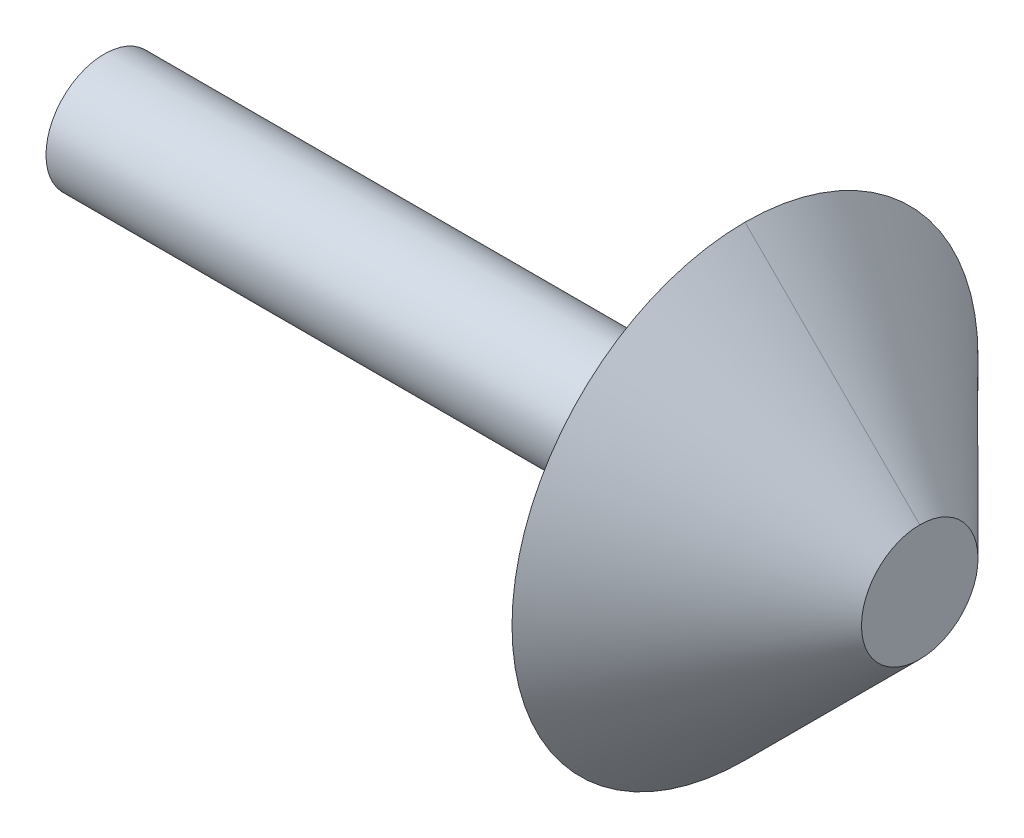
from build123d import *


with BuildPart() as part:
    # Sketch1 → Base-Revolve (revolve)
    with BuildSketch(Plane.XY, mode=Mode.PRIVATE) as base_revolve_sk:
        Polygon((0, 0), (0, 6.35), (69.85, 6.35), (69.85, 25.4), (88.9, 6.35), (88.9, 0), align=None)
    revolve(base_revolve_sk.sketch.rotate(Axis((0, 0, 0), (1, 0, 0)), 90), axis=Axis((0, 0, 0), (1, 0, 0)))


solid = part.part
